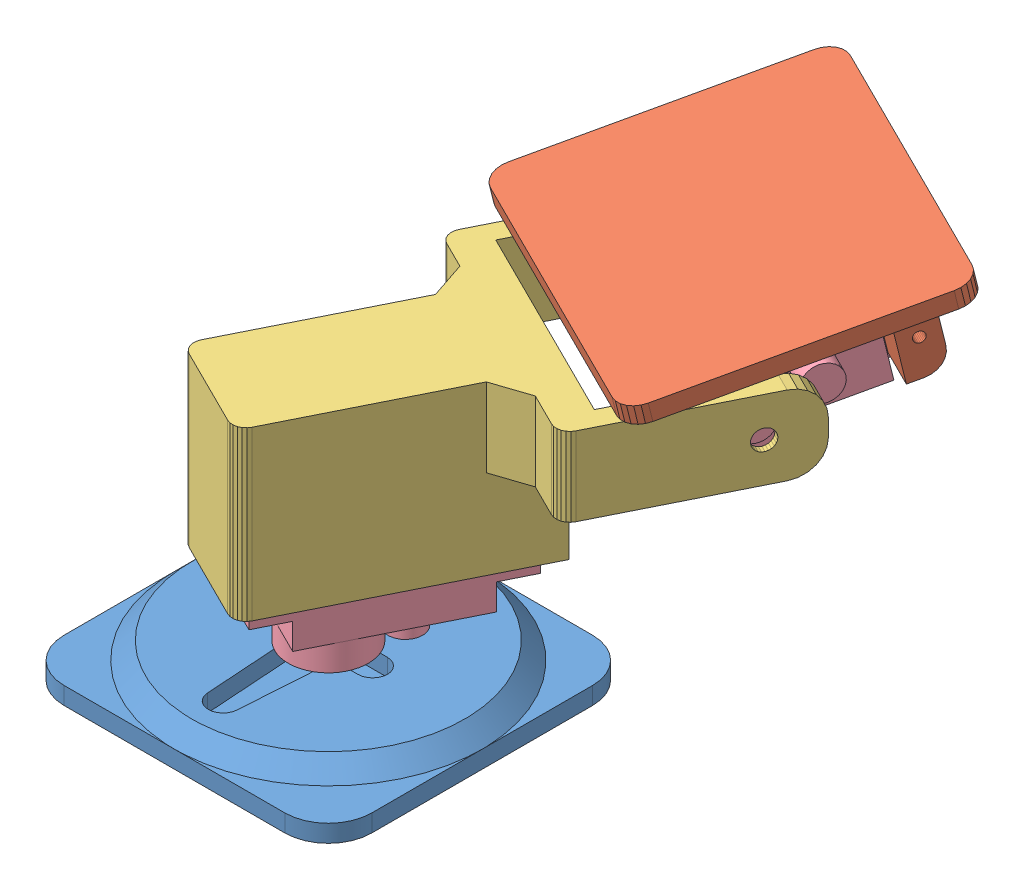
SolidWorks assembly Mount Assem_ind.SLDASM, configuration Default (file format 9000). Lengths in mm.
Overall size (71.98 50.68 93.34).
5 component instances, 4 part files, 10 mates.
Components (placement in the parent):
- Pan Tilt Platform-1: Pan Tilt Platform.SLDPRT [Default] at (7.6799 22.5439 38.2098) size (44.96 5.08 44.96)
- Pan_Tilt_Base-1: Pan_Tilt_Base.SLDPRT [Default] at (55.474 73.2198 -9.3633) x (-0.436734 -0.197916 0.877549) z (0.088181 -0.980219 -0.177186) size (40 45.5 17)
- Pan_Tilt_Top-1: Pan_Tilt_Top.SLDPRT [Default] at (-5.8286 62.2839 45.9208) x (0.445547 0 -0.895258) z (0 -1 0) size (61 38 24.5)
- SG90 Servo Motor-1: SG90 Servo Motor.SLDPRT [Default] at (22.3313 37.7839 21.882) x (-0.445547 0 0.895258) z (0.895258 0 0.445547) size (31.75 28.57 11.68)
- SG90 Servo Motor-2: SG90 Servo Motor.SLDPRT [Default] at (37.8818 66.4454 -14.5042) x (-0.436734 -0.197916 0.877549) z (-0.088181 0.980219 0.177186) size (31.75 28.57 11.68)
Mates (geometry in assembly coordinates):
- Coincident4: coincident anti-aligned: plane of Pan_Tilt_Top-1 through (-5.8286 37.7839 45.9208) normal (0 -1 0); plane of SG90 Servo Motor-1 through (22.3313 37.7839 21.882) normal (0 1 0)
- Coincident5: coincident anti-aligned: plane of Pan_Tilt_Top-1 through (22.524 60.2839 21.4948) normal (-0.895258 0 -0.445547); plane of SG90 Servo Motor-1 through (22.3313 35.2439 21.882) normal (0.895258 0 0.445547)
- Distance1: distance = 5.08 mm anti-aligned: plane of Pan_Tilt_Top-1 through (8.0437 60.2839 50.5907) normal (0.445547 0 -0.895258); plane of SG90 Servo Motor-1 through (10.3071 53.6589 46.0428) normal (-0.445547 0 0.895258)
- Concentric1: concentric aligned: circle of Pan Tilt Platform-1; cylinder of SG90 Servo Motor-1 through (7.6799 25.0839 38.2098) axis (0 1 0) radius 2.3495
- Coincident7: coincident anti-aligned: plane of Pan Tilt Platform-1 through (1.2029 25.0839 38.2098) normal (0 1 0); plane of SG90 Servo Motor-1 through (7.6799 25.0839 38.2098) normal (0 -1 0)
- Coincident11: coincident anti-aligned: plane of Pan_Tilt_Base-1 through (39.3773 73.2198 -17.3742) normal (-0.895258 0 -0.445547); plane of SG90 Servo Motor-2 through (37.9356 66.4454 -14.4774) normal (0.895258 0 0.445547)
- Coincident12: coincident anti-aligned: plane of Pan_Tilt_Base-1 through (29.3371 60.1145 16.2665) normal (0.088181 -0.980219 -0.177186); plane of SG90 Servo Motor-2 through (37.9356 66.4454 -14.4774) normal (-0.088181 0.980219 0.177186)
- Coincident13: coincident anti-aligned: plane of Pan_Tilt_Base-1 through (39.4966 66.9854 17.1746) normal (0.436734 0.197916 -0.877549); plane of SG90 Servo Motor-2 through (29.5602 61.1041 10.903) normal (-0.436734 -0.197916 0.877549)
- Concentric2: concentric aligned: circle of Pan_Tilt_Top-1; circle of SG90 Servo Motor-2
- Coincident14: coincident anti-aligned: plane of Pan_Tilt_Base-1 through (19.216 73.2198 -27.408) normal (0.895258 0 0.445547); plane of Pan_Tilt_Top-1 through (-15.005 62.2839 41.3539) normal (-0.895258 0 -0.445547)
